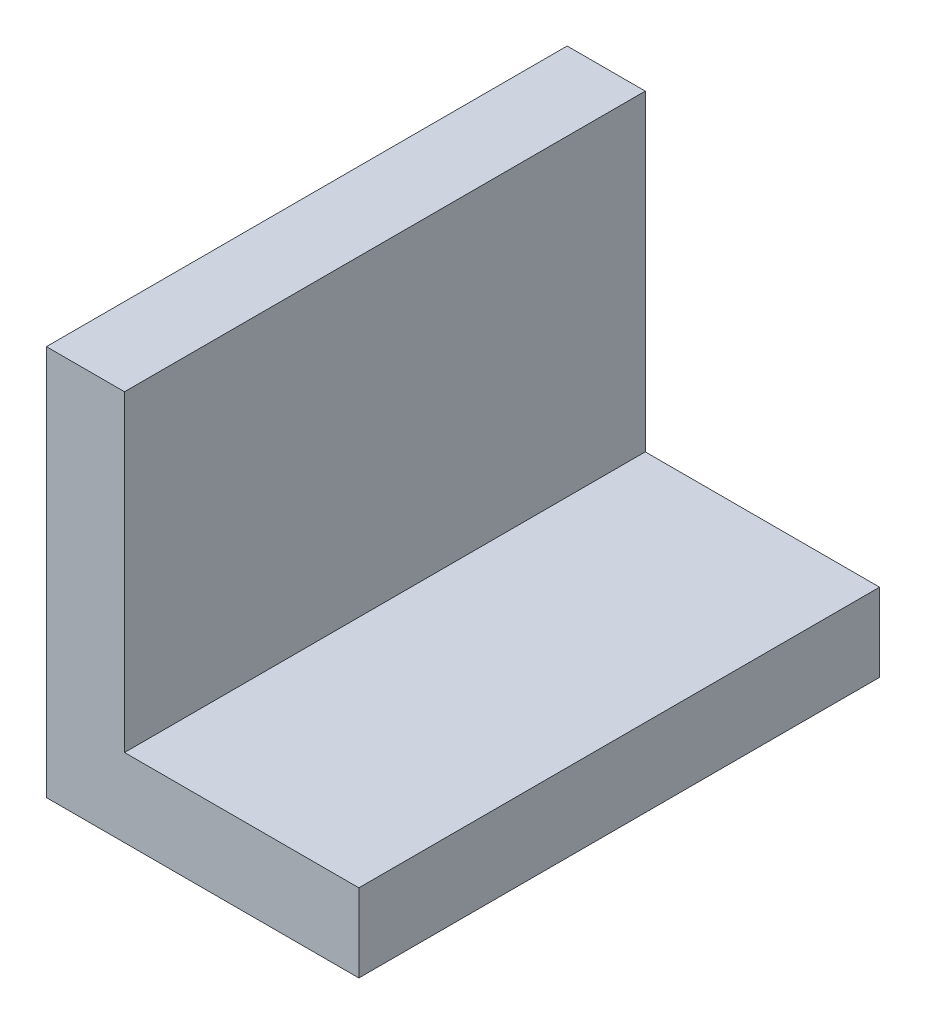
from build123d import *

# Parameters (mm, degrees)
BOSS_EXTRUDE1_DEPTH = 100


with BuildPart() as part:
    # Sketch1 → Boss-Extrude1 (new body)
    with BuildSketch(Plane.XY):
        Polygon((0, 0), (60, 0), (60, 15), (15, 15), (15, 75), (0, 75), align=None)
    extrude(amount=BOSS_EXTRUDE1_DEPTH)


solid = part.part
